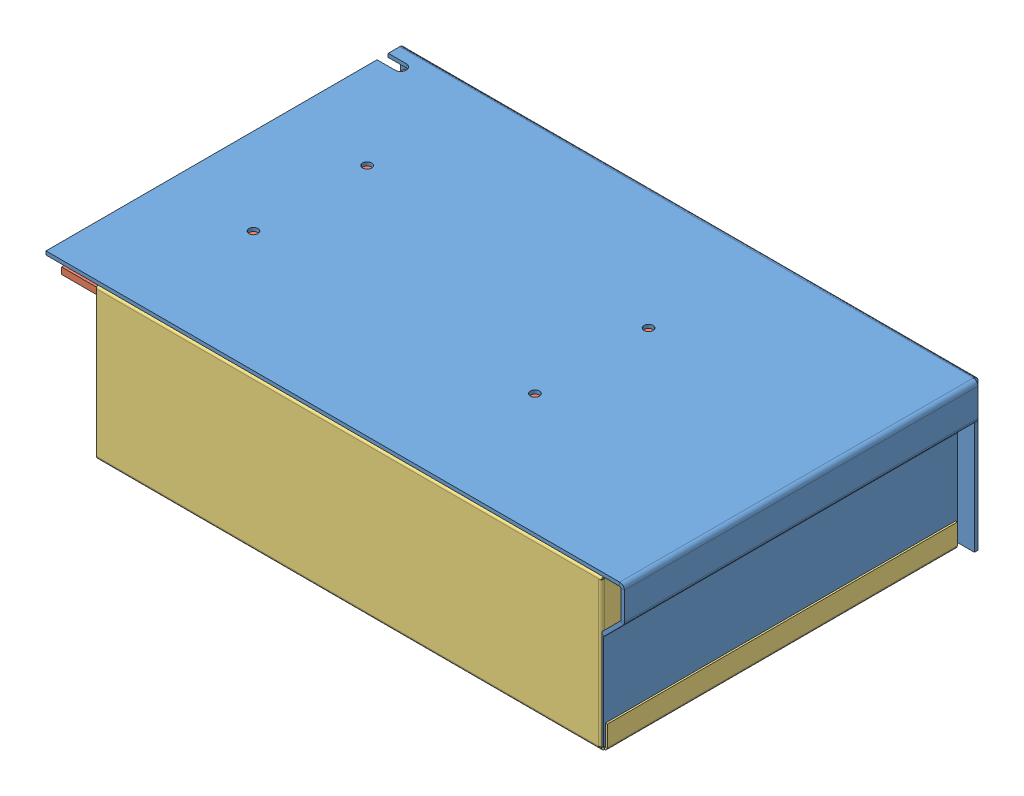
SolidWorks assembly UlTi_v1.0 - 06.07 Led Power Supply S-100-12.SLDASM, configuration По умолчанию (file format 11000). Lengths in mm.
Overall size (160.3 42.8 99.6).
3 component instances, 3 part files, 6 mates.
Components (placement in the parent):
- UlTi_v1.0 - 06.07.02 Led Power Supply S-100-12 - Box-1: UlTi_v1.0 - 06.07.02 Led Power Supply S-100-12 - Box.SLDPRT [По умолчанию] at (-7.2504 16.5997 160.95) size (160.3 42 99.3)
- UlTI_v1.0 - 06.07.03 Led Power Supply S-100-12 - Board-1: UlTI_v1.0 - 06.07.03 Led Power Supply S-100-12 - Board.SLDPRT [По умолчанию] at (-9.7504 11.5997 159.15) x (-1 0 0) z (0 0 1) size (152 18.8 95)
- UlTI_v1.0 - 06.07.01 Led Power Supply S-100-12 - Cover-1: UlTI_v1.0 - 06.07.01 Led Power Supply S-100-12 - Cover.SLDPRT [По умолчанию] at (-2.4951 -26.2003 160.95) x (0 0 -1) z (0 -1 0) size (98.6 141.6 41.8)
Mates (geometry in assembly coordinates):
- Расстояние1: distance = 4 mm: plane of UlTI_v1.0 - 06.07.03 Led Power Supply S-100-12 - Board-1 through (-9.7504 11.5997 159.15) normal (0 1 0); plane of UlTi_v1.0 - 06.07.02 Led Power Supply S-100-12 - Box-1 through (-7.2504 15.5997 160.95) normal (0 -1 0)
- Совпадение2: coincident: plane of UlTi_v1.0 - 06.07.02 Led Power Supply S-100-12 - Box-1 through (-7.2504 16.5997 111.65) normal (0 0 1); plane of UlTI_v1.0 - 06.07.03 Led Power Supply S-100-12 - Board-1 through (66.2496 9.7997 111.65) normal (0 0 -1)
- Расстояние2: distance = 1 mm: plane of UlTi_v1.0 - 06.07.02 Led Power Supply S-100-12 - Box-1 through (-86.7504 15.5997 209.95) normal (-1 0 0); plane of UlTI_v1.0 - 06.07.03 Led Power Supply S-100-12 - Board-1 through (-85.7504 9.7997 206.65) normal (-1 0 0)
- Совпадение4: coincident: plane of UlTi_v1.0 - 06.07.02 Led Power Supply S-100-12 - Box-1 through (-7.2504 16.5997 111.65) normal (0 0 1); plane of UlTI_v1.0 - 06.07.01 Led Power Supply S-100-12 - Cover-1 through (-2.4951 -26.2003 111.65) normal (0 0 -1)
- Совпадение5: coincident: plane of UlTi_v1.0 - 06.07.02 Led Power Supply S-100-12 - Box-1 through (-7.2504 15.5997 160.95) normal (0 -1 0); plane of UlTI_v1.0 - 06.07.01 Led Power Supply S-100-12 - Cover-1 through (-2.4951 15.5997 160.95) normal (0 1 0)
- Совпадение6: coincident: plane of UlTi_v1.0 - 06.07.02 Led Power Supply S-100-12 - Box-1 through (67.8049 16.5119 160.95) normal (1 0 0); plane of UlTI_v1.0 - 06.07.01 Led Power Supply S-100-12 - Cover-1 through (67.8049 -26.2003 160.95) normal (-1 0 0)
